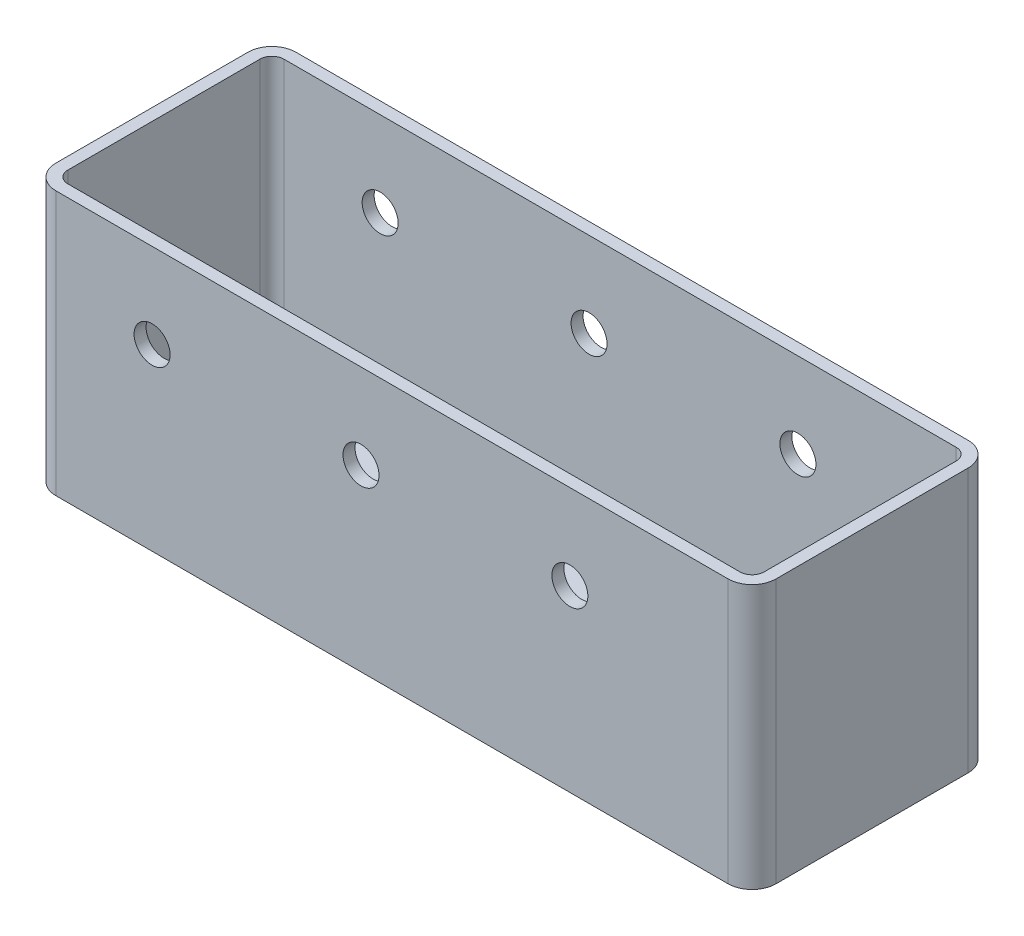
ISO-10303-21;
HEADER;
FILE_DESCRIPTION(('STEP AP214'),'2;1');
FILE_NAME('part.step','',(''),(''),'','','');
FILE_SCHEMA(('AUTOMOTIVE_DESIGN { 1 0 10303 214 1 1 1 1 }'));
ENDSEC;
DATA;
#1=APPLICATION_CONTEXT('core data for automotive mechanical design processes');
#2=APPLICATION_PROTOCOL_DEFINITION('international standard','automotive_design',2000,#1);
#3=PRODUCT_CONTEXT('',#1,'mechanical');
#4=PRODUCT('Part','Part','',(#3));
#5=PRODUCT_RELATED_PRODUCT_CATEGORY('part','',(#4));
#6=PRODUCT_DEFINITION_FORMATION('','',#4);
#7=PRODUCT_DEFINITION_CONTEXT('part definition',#1,'design');
#8=PRODUCT_DEFINITION('design','',#6,#7);
#9=PRODUCT_DEFINITION_SHAPE('','',#8);
#10=(LENGTH_UNIT() NAMED_UNIT(*) SI_UNIT(.MILLI.,.METRE.));
#11=(NAMED_UNIT(*) PLANE_ANGLE_UNIT() SI_UNIT($,.RADIAN.));
#12=(NAMED_UNIT(*) SI_UNIT($,.STERADIAN.) SOLID_ANGLE_UNIT());
#13=UNCERTAINTY_MEASURE_WITH_UNIT(LENGTH_MEASURE(1.E-05),#10,'distance_accuracy_value','');
#14=(GEOMETRIC_REPRESENTATION_CONTEXT(3) GLOBAL_UNCERTAINTY_ASSIGNED_CONTEXT((#13)) GLOBAL_UNIT_ASSIGNED_CONTEXT((#10,
#11,#12)) REPRESENTATION_CONTEXT('',''));
#15=CARTESIAN_POINT('',(0.,0.,0.));
#16=DIRECTION('',(0.,0.,1.));
#17=DIRECTION('',(1.,0.,0.));
#18=AXIS2_PLACEMENT_3D('',#15,#16,#17);
#19=CARTESIAN_POINT('',(355.6,12.7,101.6));
#20=DIRECTION('',(0.,-1.,0.));
#21=DIRECTION('',(0.,0.,-1.));
#22=AXIS2_PLACEMENT_3D('',#19,#20,#21);
#23=CYLINDRICAL_SURFACE('',#22,25.4);
#24=CARTESIAN_POINT('',(355.6,0.,101.6));
#25=DIRECTION('',(0.,1.,0.));
#26=DIRECTION('',(0.,0.,-1.));
#27=AXIS2_PLACEMENT_3D('',#24,#25,#26);
#28=CIRCLE('',#27,25.4);
#29=CARTESIAN_POINT('',(355.6,0.,127.));
#30=VERTEX_POINT('',#29);
#31=CARTESIAN_POINT('',(381.,0.,101.6));
#32=VERTEX_POINT('',#31);
#33=EDGE_CURVE('E249',#30,#32,#28,.T.);
#34=ORIENTED_EDGE('',*,*,#33,.T.);
#35=DIRECTION('',(0.,-1.,0.));
#36=VECTOR('',#35,1.);
#37=CARTESIAN_POINT('',(381.,12.7,101.6));
#38=LINE('',#37,#36);
#39=CARTESIAN_POINT('',(381.,279.400000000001,101.6));
#40=VERTEX_POINT('',#39);
#41=EDGE_CURVE('E11',#40,#32,#38,.T.);
#42=ORIENTED_EDGE('',*,*,#41,.F.);
#43=CARTESIAN_POINT('',(355.6,279.400000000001,101.6));
#44=DIRECTION('',(0.,1.,0.));
#45=DIRECTION('',(0.,0.,1.));
#46=AXIS2_PLACEMENT_3D('',#43,#44,#45);
#47=CIRCLE('',#46,25.4);
#48=CARTESIAN_POINT('',(355.6,279.400000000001,127.));
#49=VERTEX_POINT('',#48);
#50=EDGE_CURVE('E171',#49,#40,#47,.T.);
#51=ORIENTED_EDGE('',*,*,#50,.F.);
#52=DIRECTION('',(0.,-1.,0.));
#53=VECTOR('',#52,1.);
#54=CARTESIAN_POINT('',(355.6,12.7,127.));
#55=LINE('',#54,#53);
#56=EDGE_CURVE('E265',#49,#30,#55,.T.);
#57=ORIENTED_EDGE('',*,*,#56,.T.);
#58=EDGE_LOOP('',(#34,#42,#51,#57));
#59=FACE_BOUND('',#58,.T.);
#60=ADVANCED_FACE('F39',(#59),#23,.T.);
#61=CARTESIAN_POINT('',(381.,12.7,-101.6));
#62=DIRECTION('',(-1.,0.,0.));
#63=DIRECTION('',(0.,0.,1.));
#64=AXIS2_PLACEMENT_3D('',#61,#62,#63);
#65=PLANE('',#64);
#66=DIRECTION('',(0.,0.,-1.));
#67=VECTOR('',#66,1.);
#68=CARTESIAN_POINT('',(381.,0.,-101.6));
#69=LINE('',#68,#67);
#70=CARTESIAN_POINT('',(381.,0.,-101.6));
#71=VERTEX_POINT('',#70);
#72=EDGE_CURVE('E252',#32,#71,#69,.T.);
#73=ORIENTED_EDGE('',*,*,#72,.T.);
#74=DIRECTION('',(0.,-1.,0.));
#75=VECTOR('',#74,1.);
#76=CARTESIAN_POINT('',(381.,12.7,-101.6));
#77=LINE('',#76,#75);
#78=CARTESIAN_POINT('',(381.,279.400000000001,-101.6));
#79=VERTEX_POINT('',#78);
#80=EDGE_CURVE('E47',#79,#71,#77,.T.);
#81=ORIENTED_EDGE('',*,*,#80,.F.);
#82=DIRECTION('',(0.,0.,-1.));
#83=VECTOR('',#82,1.);
#84=CARTESIAN_POINT('',(381.,279.400000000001,101.6));
#85=LINE('',#84,#83);
#86=EDGE_CURVE('E228',#40,#79,#85,.T.);
#87=ORIENTED_EDGE('',*,*,#86,.F.);
#88=ORIENTED_EDGE('',*,*,#41,.T.);
#89=EDGE_LOOP('',(#73,#81,#87,#88));
#90=FACE_BOUND('',#89,.T.);
#91=ADVANCED_FACE('F340',(#90),#65,.F.);
#92=CARTESIAN_POINT('',(355.6,12.7,-101.6));
#93=DIRECTION('',(0.,-1.,0.));
#94=DIRECTION('',(0.,0.,-1.));
#95=AXIS2_PLACEMENT_3D('',#92,#93,#94);
#96=CYLINDRICAL_SURFACE('',#95,25.4);
#97=CARTESIAN_POINT('',(355.6,0.,-101.6));
#98=DIRECTION('',(0.,1.,0.));
#99=DIRECTION('',(0.,0.,-1.));
#100=AXIS2_PLACEMENT_3D('',#97,#98,#99);
#101=CIRCLE('',#100,25.4);
#102=CARTESIAN_POINT('',(355.6,0.,-127.));
#103=VERTEX_POINT('',#102);
#104=EDGE_CURVE('E254',#71,#103,#101,.T.);
#105=ORIENTED_EDGE('',*,*,#104,.T.);
#106=DIRECTION('',(0.,-1.,0.));
#107=VECTOR('',#106,1.);
#108=CARTESIAN_POINT('',(355.6,12.7,-127.));
#109=LINE('',#108,#107);
#110=CARTESIAN_POINT('',(355.6,279.400000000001,-127.));
#111=VERTEX_POINT('',#110);
#112=EDGE_CURVE('E278',#111,#103,#109,.T.);
#113=ORIENTED_EDGE('',*,*,#112,.F.);
#114=CARTESIAN_POINT('',(355.6,279.400000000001,-101.6));
#115=DIRECTION('',(0.,1.,0.));
#116=DIRECTION('',(0.,0.,1.));
#117=AXIS2_PLACEMENT_3D('',#114,#115,#116);
#118=CIRCLE('',#117,25.4);
#119=EDGE_CURVE('E231',#79,#111,#118,.T.);
#120=ORIENTED_EDGE('',*,*,#119,.F.);
#121=ORIENTED_EDGE('',*,*,#80,.T.);
#122=EDGE_LOOP('',(#105,#113,#120,#121));
#123=FACE_BOUND('',#122,.T.);
#124=ADVANCED_FACE('F345',(#123),#96,.T.);
#125=CARTESIAN_POINT('',(355.6,12.7,-127.));
#126=DIRECTION('',(0.,0.,1.));
#127=DIRECTION('',(1.,0.,0.));
#128=AXIS2_PLACEMENT_3D('',#125,#126,#127);
#129=PLANE('',#128);
#130=CARTESIAN_POINT('',(-253.79825288,189.484,-127.));
#131=DIRECTION('',(0.,0.,1.));
#132=DIRECTION('',(1.,0.,0.));
#133=AXIS2_PLACEMENT_3D('',#130,#131,#132);
#134=CIRCLE('',#133,19.05);
#135=CARTESIAN_POINT('',(-234.74825288,189.484,-127.));
#136=VERTEX_POINT('',#135);
#137=EDGE_CURVE('E195',#136,#136,#134,.T.);
#138=ORIENTED_EDGE('',*,*,#137,.T.);
#139=EDGE_LOOP('',(#138));
#140=FACE_BOUND('',#139,.T.);
#141=CARTESIAN_POINT('',(-32.7660000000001,189.484,-127.));
#142=DIRECTION('',(0.,0.,1.));
#143=DIRECTION('',(1.,0.,0.));
#144=AXIS2_PLACEMENT_3D('',#141,#142,#143);
#145=CIRCLE('',#144,19.05);
#146=CARTESIAN_POINT('',(-13.7160000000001,189.484,-127.));
#147=VERTEX_POINT('',#146);
#148=EDGE_CURVE('E306',#147,#147,#145,.T.);
#149=ORIENTED_EDGE('',*,*,#148,.T.);
#150=EDGE_LOOP('',(#149));
#151=FACE_BOUND('',#150,.T.);
#152=CARTESIAN_POINT('',(188.214,189.484,-127.));
#153=DIRECTION('',(0.,0.,1.));
#154=DIRECTION('',(1.,0.,0.));
#155=AXIS2_PLACEMENT_3D('',#152,#153,#154);
#156=CIRCLE('',#155,19.05);
#157=CARTESIAN_POINT('',(207.264,189.484,-127.));
#158=VERTEX_POINT('',#157);
#159=EDGE_CURVE('E289',#158,#158,#156,.T.);
#160=ORIENTED_EDGE('',*,*,#159,.T.);
#161=EDGE_LOOP('',(#160));
#162=FACE_BOUND('',#161,.T.);
#163=DIRECTION('',(-1.,0.,0.));
#164=VECTOR('',#163,1.);
#165=CARTESIAN_POINT('',(355.6,0.,-127.));
#166=LINE('',#165,#164);
#167=CARTESIAN_POINT('',(-355.6,0.,-127.));
#168=VERTEX_POINT('',#167);
#169=EDGE_CURVE('E256',#103,#168,#166,.T.);
#170=ORIENTED_EDGE('',*,*,#169,.T.);
#171=DIRECTION('',(0.,-1.,0.));
#172=VECTOR('',#171,1.);
#173=CARTESIAN_POINT('',(-355.6,12.7,-127.));
#174=LINE('',#173,#172);
#175=CARTESIAN_POINT('',(-355.6,279.400000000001,-127.));
#176=VERTEX_POINT('',#175);
#177=EDGE_CURVE('E275',#176,#168,#174,.T.);
#178=ORIENTED_EDGE('',*,*,#177,.F.);
#179=DIRECTION('',(-1.,0.,0.));
#180=VECTOR('',#179,1.);
#181=CARTESIAN_POINT('',(355.6,279.400000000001,-127.));
#182=LINE('',#181,#180);
#183=EDGE_CURVE('E234',#111,#176,#182,.T.);
#184=ORIENTED_EDGE('',*,*,#183,.F.);
#185=ORIENTED_EDGE('',*,*,#112,.T.);
#186=EDGE_LOOP('',(#170,#178,#184,#185));
#187=FACE_BOUND('',#186,.T.);
#188=ADVANCED_FACE('F317',(#140,#151,#162,#187),#129,.F.);
#189=CARTESIAN_POINT('',(-355.6,12.7,-101.6));
#190=DIRECTION('',(0.,-1.,0.));
#191=DIRECTION('',(0.,0.,-1.));
#192=AXIS2_PLACEMENT_3D('',#189,#190,#191);
#193=CYLINDRICAL_SURFACE('',#192,25.4);
#194=CARTESIAN_POINT('',(-355.6,0.,-101.6));
#195=DIRECTION('',(0.,1.,0.));
#196=DIRECTION('',(0.,0.,1.));
#197=AXIS2_PLACEMENT_3D('',#194,#195,#196);
#198=CIRCLE('',#197,25.4);
#199=CARTESIAN_POINT('',(-381.,0.,-101.6));
#200=VERTEX_POINT('',#199);
#201=EDGE_CURVE('E258',#168,#200,#198,.T.);
#202=ORIENTED_EDGE('',*,*,#201,.T.);
#203=DIRECTION('',(0.,-1.,0.));
#204=VECTOR('',#203,1.);
#205=CARTESIAN_POINT('',(-381.,12.7,-101.6));
#206=LINE('',#205,#204);
#207=CARTESIAN_POINT('',(-381.,279.400000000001,-101.6));
#208=VERTEX_POINT('',#207);
#209=EDGE_CURVE('E272',#208,#200,#206,.T.);
#210=ORIENTED_EDGE('',*,*,#209,.F.);
#211=CARTESIAN_POINT('',(-355.6,279.400000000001,-101.6));
#212=DIRECTION('',(0.,1.,0.));
#213=DIRECTION('',(0.,0.,1.));
#214=AXIS2_PLACEMENT_3D('',#211,#212,#213);
#215=CIRCLE('',#214,25.4);
#216=EDGE_CURVE('E237',#176,#208,#215,.T.);
#217=ORIENTED_EDGE('',*,*,#216,.F.);
#218=ORIENTED_EDGE('',*,*,#177,.T.);
#219=EDGE_LOOP('',(#202,#210,#217,#218));
#220=FACE_BOUND('',#219,.T.);
#221=ADVANCED_FACE('F369',(#220),#193,.T.);
#222=CARTESIAN_POINT('',(-381.,12.7,-101.6));
#223=DIRECTION('',(1.,0.,0.));
#224=DIRECTION('',(0.,0.,-1.));
#225=AXIS2_PLACEMENT_3D('',#222,#223,#224);
#226=PLANE('',#225);
#227=DIRECTION('',(0.,0.,1.));
#228=VECTOR('',#227,1.);
#229=CARTESIAN_POINT('',(-381.,0.,-101.6));
#230=LINE('',#229,#228);
#231=CARTESIAN_POINT('',(-381.,0.,101.6));
#232=VERTEX_POINT('',#231);
#233=EDGE_CURVE('E260',#200,#232,#230,.T.);
#234=ORIENTED_EDGE('',*,*,#233,.T.);
#235=DIRECTION('',(0.,-1.,0.));
#236=VECTOR('',#235,1.);
#237=CARTESIAN_POINT('',(-381.,12.7,101.6));
#238=LINE('',#237,#236);
#239=CARTESIAN_POINT('',(-381.,279.400000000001,101.6));
#240=VERTEX_POINT('',#239);
#241=EDGE_CURVE('E269',#240,#232,#238,.T.);
#242=ORIENTED_EDGE('',*,*,#241,.F.);
#243=DIRECTION('',(0.,0.,1.));
#244=VECTOR('',#243,1.);
#245=CARTESIAN_POINT('',(-381.,279.400000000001,-101.6));
#246=LINE('',#245,#244);
#247=EDGE_CURVE('E240',#208,#240,#246,.T.);
#248=ORIENTED_EDGE('',*,*,#247,.F.);
#249=ORIENTED_EDGE('',*,*,#209,.T.);
#250=EDGE_LOOP('',(#234,#242,#248,#249));
#251=FACE_BOUND('',#250,.T.);
#252=ADVANCED_FACE('F365',(#251),#226,.F.);
#253=CARTESIAN_POINT('',(-355.6,12.7,101.6));
#254=DIRECTION('',(0.,-1.,0.));
#255=DIRECTION('',(0.,0.,-1.));
#256=AXIS2_PLACEMENT_3D('',#253,#254,#255);
#257=CYLINDRICAL_SURFACE('',#256,25.4);
#258=CARTESIAN_POINT('',(-355.6,0.,101.6));
#259=DIRECTION('',(0.,1.,0.));
#260=DIRECTION('',(0.,0.,-1.));
#261=AXIS2_PLACEMENT_3D('',#258,#259,#260);
#262=CIRCLE('',#261,25.4);
#263=CARTESIAN_POINT('',(-355.6,0.,127.));
#264=VERTEX_POINT('',#263);
#265=EDGE_CURVE('E262',#232,#264,#262,.T.);
#266=ORIENTED_EDGE('',*,*,#265,.T.);
#267=DIRECTION('',(0.,-1.,0.));
#268=VECTOR('',#267,1.);
#269=CARTESIAN_POINT('',(-355.6,12.7,127.));
#270=LINE('',#269,#268);
#271=CARTESIAN_POINT('',(-355.6,279.400000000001,127.));
#272=VERTEX_POINT('',#271);
#273=EDGE_CURVE('E267',#272,#264,#270,.T.);
#274=ORIENTED_EDGE('',*,*,#273,.F.);
#275=CARTESIAN_POINT('',(-355.6,279.400000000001,101.6));
#276=DIRECTION('',(0.,1.,0.));
#277=DIRECTION('',(0.,0.,1.));
#278=AXIS2_PLACEMENT_3D('',#275,#276,#277);
#279=CIRCLE('',#278,25.4);
#280=EDGE_CURVE('E243',#240,#272,#279,.T.);
#281=ORIENTED_EDGE('',*,*,#280,.F.);
#282=ORIENTED_EDGE('',*,*,#241,.T.);
#283=EDGE_LOOP('',(#266,#274,#281,#282));
#284=FACE_BOUND('',#283,.T.);
#285=ADVANCED_FACE('F361',(#284),#257,.T.);
#286=CARTESIAN_POINT('',(355.6,12.7,127.));
#287=DIRECTION('',(0.,0.,-1.));
#288=DIRECTION('',(-1.,0.,0.));
#289=AXIS2_PLACEMENT_3D('',#286,#287,#288);
#290=PLANE('',#289);
#291=CARTESIAN_POINT('',(-253.79825288,189.484,127.));
#292=DIRECTION('',(0.,0.,-1.));
#293=DIRECTION('',(-1.,0.,0.));
#294=AXIS2_PLACEMENT_3D('',#291,#292,#293);
#295=CIRCLE('',#294,19.05);
#296=CARTESIAN_POINT('',(-272.84825288,189.484,127.));
#297=VERTEX_POINT('',#296);
#298=EDGE_CURVE('E312',#297,#297,#295,.T.);
#299=ORIENTED_EDGE('',*,*,#298,.T.);
#300=EDGE_LOOP('',(#299));
#301=FACE_BOUND('',#300,.T.);
#302=CARTESIAN_POINT('',(-32.7660000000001,189.484,127.));
#303=DIRECTION('',(0.,0.,-1.));
#304=DIRECTION('',(-1.,0.,0.));
#305=AXIS2_PLACEMENT_3D('',#302,#303,#304);
#306=CIRCLE('',#305,19.05);
#307=CARTESIAN_POINT('',(-51.8160000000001,189.484,127.));
#308=VERTEX_POINT('',#307);
#309=EDGE_CURVE('E293',#308,#308,#306,.T.);
#310=ORIENTED_EDGE('',*,*,#309,.T.);
#311=EDGE_LOOP('',(#310));
#312=FACE_BOUND('',#311,.T.);
#313=CARTESIAN_POINT('',(188.214,189.484,127.));
#314=DIRECTION('',(0.,0.,-1.));
#315=DIRECTION('',(-1.,0.,0.));
#316=AXIS2_PLACEMENT_3D('',#313,#314,#315);
#317=CIRCLE('',#316,19.05);
#318=CARTESIAN_POINT('',(169.164,189.484,127.));
#319=VERTEX_POINT('',#318);
#320=EDGE_CURVE('E296',#319,#319,#317,.T.);
#321=ORIENTED_EDGE('',*,*,#320,.T.);
#322=EDGE_LOOP('',(#321));
#323=FACE_BOUND('',#322,.T.);
#324=DIRECTION('',(1.,0.,0.));
#325=VECTOR('',#324,1.);
#326=CARTESIAN_POINT('',(355.6,0.,127.));
#327=LINE('',#326,#325);
#328=EDGE_CURVE('E63',#264,#30,#327,.T.);
#329=ORIENTED_EDGE('',*,*,#328,.T.);
#330=ORIENTED_EDGE('',*,*,#56,.F.);
#331=DIRECTION('',(1.,0.,0.));
#332=VECTOR('',#331,1.);
#333=CARTESIAN_POINT('',(-355.6,279.400000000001,127.));
#334=LINE('',#333,#332);
#335=EDGE_CURVE('E246',#272,#49,#334,.T.);
#336=ORIENTED_EDGE('',*,*,#335,.F.);
#337=ORIENTED_EDGE('',*,*,#273,.T.);
#338=EDGE_LOOP('',(#329,#330,#336,#337));
#339=FACE_BOUND('',#338,.T.);
#340=ADVANCED_FACE('F359',(#301,#312,#323,#339),#290,.F.);
#341=CARTESIAN_POINT('',(355.6,0.,101.6));
#342=DIRECTION('',(0.,-1.,0.));
#343=DIRECTION('',(0.,0.,-1.));
#344=AXIS2_PLACEMENT_3D('',#341,#342,#343);
#345=PLANE('',#344);
#346=ORIENTED_EDGE('',*,*,#33,.F.);
#347=ORIENTED_EDGE('',*,*,#328,.F.);
#348=ORIENTED_EDGE('',*,*,#265,.F.);
#349=ORIENTED_EDGE('',*,*,#233,.F.);
#350=ORIENTED_EDGE('',*,*,#201,.F.);
#351=ORIENTED_EDGE('',*,*,#169,.F.);
#352=ORIENTED_EDGE('',*,*,#104,.F.);
#353=ORIENTED_EDGE('',*,*,#72,.F.);
#354=EDGE_LOOP('',(#346,#347,#348,#349,#350,#351,#352,#353));
#355=FACE_BOUND('',#354,.T.);
#356=ADVANCED_FACE('F351',(#355),#345,.T.);
#357=CARTESIAN_POINT('',(355.6,279.400000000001,101.6));
#358=DIRECTION('',(0.,1.,0.));
#359=DIRECTION('',(0.,0.,1.));
#360=AXIS2_PLACEMENT_3D('',#357,#358,#359);
#361=PLANE('',#360);
#362=ORIENTED_EDGE('',*,*,#50,.T.);
#363=ORIENTED_EDGE('',*,*,#86,.T.);
#364=ORIENTED_EDGE('',*,*,#119,.T.);
#365=ORIENTED_EDGE('',*,*,#183,.T.);
#366=ORIENTED_EDGE('',*,*,#216,.T.);
#367=ORIENTED_EDGE('',*,*,#247,.T.);
#368=ORIENTED_EDGE('',*,*,#280,.T.);
#369=ORIENTED_EDGE('',*,*,#335,.T.);
#370=EDGE_LOOP('',(#362,#363,#364,#365,#366,#367,#368,#369));
#371=FACE_BOUND('',#370,.T.);
#372=DIRECTION('',(0.,0.,1.));
#373=VECTOR('',#372,1.);
#374=CARTESIAN_POINT('',(-368.3,279.400000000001,-101.6));
#375=LINE('',#374,#373);
#376=CARTESIAN_POINT('',(-368.3,279.400000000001,-101.6));
#377=VERTEX_POINT('',#376);
#378=CARTESIAN_POINT('',(-368.3,279.400000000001,101.6));
#379=VERTEX_POINT('',#378);
#380=EDGE_CURVE('E163',#377,#379,#375,.T.);
#381=ORIENTED_EDGE('',*,*,#380,.F.);
#382=CARTESIAN_POINT('',(-355.6,279.400000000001,-101.6));
#383=DIRECTION('',(0.,1.,0.));
#384=DIRECTION('',(0.,0.,1.));
#385=AXIS2_PLACEMENT_3D('',#382,#383,#384);
#386=CIRCLE('',#385,12.7);
#387=CARTESIAN_POINT('',(-355.6,279.400000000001,-114.3));
#388=VERTEX_POINT('',#387);
#389=EDGE_CURVE('E155',#388,#377,#386,.T.);
#390=ORIENTED_EDGE('',*,*,#389,.F.);
#391=DIRECTION('',(-1.,0.,0.));
#392=VECTOR('',#391,1.);
#393=CARTESIAN_POINT('',(355.6,279.400000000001,-114.3));
#394=LINE('',#393,#392);
#395=CARTESIAN_POINT('',(355.6,279.400000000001,-114.3));
#396=VERTEX_POINT('',#395);
#397=EDGE_CURVE('E191',#396,#388,#394,.T.);
#398=ORIENTED_EDGE('',*,*,#397,.F.);
#399=CARTESIAN_POINT('',(355.6,279.400000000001,-101.6));
#400=DIRECTION('',(0.,1.,0.));
#401=DIRECTION('',(0.,0.,1.));
#402=AXIS2_PLACEMENT_3D('',#399,#400,#401);
#403=CIRCLE('',#402,12.7);
#404=CARTESIAN_POINT('',(368.3,279.400000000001,-101.6));
#405=VERTEX_POINT('',#404);
#406=EDGE_CURVE('E188',#405,#396,#403,.T.);
#407=ORIENTED_EDGE('',*,*,#406,.F.);
#408=DIRECTION('',(0.,0.,-1.));
#409=VECTOR('',#408,1.);
#410=CARTESIAN_POINT('',(368.3,279.400000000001,101.6));
#411=LINE('',#410,#409);
#412=CARTESIAN_POINT('',(368.3,279.400000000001,101.6));
#413=VERTEX_POINT('',#412);
#414=EDGE_CURVE('E186',#413,#405,#411,.T.);
#415=ORIENTED_EDGE('',*,*,#414,.F.);
#416=CARTESIAN_POINT('',(355.6,279.400000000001,101.6));
#417=DIRECTION('',(0.,1.,0.));
#418=DIRECTION('',(0.,0.,1.));
#419=AXIS2_PLACEMENT_3D('',#416,#417,#418);
#420=CIRCLE('',#419,12.7);
#421=CARTESIAN_POINT('',(355.6,279.400000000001,114.3));
#422=VERTEX_POINT('',#421);
#423=EDGE_CURVE('E184',#422,#413,#420,.T.);
#424=ORIENTED_EDGE('',*,*,#423,.F.);
#425=DIRECTION('',(1.,0.,0.));
#426=VECTOR('',#425,1.);
#427=CARTESIAN_POINT('',(-355.6,279.400000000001,114.3));
#428=LINE('',#427,#426);
#429=CARTESIAN_POINT('',(-355.6,279.400000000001,114.3));
#430=VERTEX_POINT('',#429);
#431=EDGE_CURVE('E179',#430,#422,#428,.T.);
#432=ORIENTED_EDGE('',*,*,#431,.F.);
#433=CARTESIAN_POINT('',(-355.6,279.400000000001,101.6));
#434=DIRECTION('',(0.,1.,0.));
#435=DIRECTION('',(0.,0.,1.));
#436=AXIS2_PLACEMENT_3D('',#433,#434,#435);
#437=CIRCLE('',#436,12.7);
#438=EDGE_CURVE('E177',#379,#430,#437,.T.);
#439=ORIENTED_EDGE('',*,*,#438,.F.);
#440=EDGE_LOOP('',(#381,#390,#398,#407,#415,#424,#432,#439));
#441=FACE_BOUND('',#440,.T.);
#442=ADVANCED_FACE('F175',(#371,#441),#361,.T.);
#443=CARTESIAN_POINT('',(-355.6,279.400000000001,-101.6));
#444=DIRECTION('',(0.,-1.,0.));
#445=DIRECTION('',(0.,0.,-1.));
#446=AXIS2_PLACEMENT_3D('',#443,#444,#445);
#447=CYLINDRICAL_SURFACE('',#446,12.7);
#448=CARTESIAN_POINT('',(-355.6,12.7,-101.6));
#449=DIRECTION('',(0.,1.,0.));
#450=DIRECTION('',(0.,0.,1.));
#451=AXIS2_PLACEMENT_3D('',#448,#449,#450);
#452=CIRCLE('',#451,12.7);
#453=CARTESIAN_POINT('',(-355.6,12.7,-114.3));
#454=VERTEX_POINT('',#453);
#455=CARTESIAN_POINT('',(-368.3,12.7,-101.6));
#456=VERTEX_POINT('',#455);
#457=EDGE_CURVE('E193',#454,#456,#452,.T.);
#458=ORIENTED_EDGE('',*,*,#457,.F.);
#459=DIRECTION('',(0.,-1.,0.));
#460=VECTOR('',#459,1.);
#461=CARTESIAN_POINT('',(-355.6,279.400000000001,-114.3));
#462=LINE('',#461,#460);
#463=EDGE_CURVE('E55',#388,#454,#462,.T.);
#464=ORIENTED_EDGE('',*,*,#463,.F.);
#465=ORIENTED_EDGE('',*,*,#389,.T.);
#466=DIRECTION('',(0.,-1.,0.));
#467=VECTOR('',#466,1.);
#468=CARTESIAN_POINT('',(-368.3,279.400000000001,-101.6));
#469=LINE('',#468,#467);
#470=EDGE_CURVE('E158',#377,#456,#469,.T.);
#471=ORIENTED_EDGE('',*,*,#470,.T.);
#472=EDGE_LOOP('',(#458,#464,#465,#471));
#473=FACE_BOUND('',#472,.T.);
#474=ADVANCED_FACE('F157',(#473),#447,.F.);
#475=CARTESIAN_POINT('',(-368.3,279.400000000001,-101.6));
#476=DIRECTION('',(1.,0.,0.));
#477=DIRECTION('',(0.,0.,-1.));
#478=AXIS2_PLACEMENT_3D('',#475,#476,#477);
#479=PLANE('',#478);
#480=DIRECTION('',(0.,0.,1.));
#481=VECTOR('',#480,1.);
#482=CARTESIAN_POINT('',(-368.3,12.7,-101.6));
#483=LINE('',#482,#481);
#484=CARTESIAN_POINT('',(-368.3,12.7,101.6));
#485=VERTEX_POINT('',#484);
#486=EDGE_CURVE('E170',#456,#485,#483,.T.);
#487=ORIENTED_EDGE('',*,*,#486,.F.);
#488=ORIENTED_EDGE('',*,*,#470,.F.);
#489=ORIENTED_EDGE('',*,*,#380,.T.);
#490=DIRECTION('',(0.,-1.,0.));
#491=VECTOR('',#490,1.);
#492=CARTESIAN_POINT('',(-368.3,279.400000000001,101.6));
#493=LINE('',#492,#491);
#494=EDGE_CURVE('E172',#379,#485,#493,.T.);
#495=ORIENTED_EDGE('',*,*,#494,.T.);
#496=EDGE_LOOP('',(#487,#488,#489,#495));
#497=FACE_BOUND('',#496,.T.);
#498=ADVANCED_FACE('F167',(#497),#479,.T.);
#499=CARTESIAN_POINT('',(-355.6,279.400000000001,101.6));
#500=DIRECTION('',(0.,-1.,0.));
#501=DIRECTION('',(0.,0.,-1.));
#502=AXIS2_PLACEMENT_3D('',#499,#500,#501);
#503=CYLINDRICAL_SURFACE('',#502,12.7);
#504=CARTESIAN_POINT('',(-355.6,12.7,101.6));
#505=DIRECTION('',(0.,1.,0.));
#506=DIRECTION('',(0.,0.,1.));
#507=AXIS2_PLACEMENT_3D('',#504,#505,#506);
#508=CIRCLE('',#507,12.7);
#509=CARTESIAN_POINT('',(-355.6,12.7,114.3));
#510=VERTEX_POINT('',#509);
#511=EDGE_CURVE('E197',#485,#510,#508,.T.);
#512=ORIENTED_EDGE('',*,*,#511,.F.);
#513=ORIENTED_EDGE('',*,*,#494,.F.);
#514=ORIENTED_EDGE('',*,*,#438,.T.);
#515=DIRECTION('',(0.,-1.,0.));
#516=VECTOR('',#515,1.);
#517=CARTESIAN_POINT('',(-355.6,279.400000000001,114.3));
#518=LINE('',#517,#516);
#519=EDGE_CURVE('E223',#430,#510,#518,.T.);
#520=ORIENTED_EDGE('',*,*,#519,.T.);
#521=EDGE_LOOP('',(#512,#513,#514,#520));
#522=FACE_BOUND('',#521,.T.);
#523=ADVANCED_FACE('F402',(#522),#503,.F.);
#524=CARTESIAN_POINT('',(-355.6,279.400000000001,114.3));
#525=DIRECTION('',(0.,0.,-1.));
#526=DIRECTION('',(-1.,0.,0.));
#527=AXIS2_PLACEMENT_3D('',#524,#525,#526);
#528=PLANE('',#527);
#529=CARTESIAN_POINT('',(-253.79825288,189.484,114.3));
#530=DIRECTION('',(0.,0.,-1.));
#531=DIRECTION('',(-1.,0.,0.));
#532=AXIS2_PLACEMENT_3D('',#529,#530,#531);
#533=CIRCLE('',#532,19.05);
#534=CARTESIAN_POINT('',(-272.84825288,189.484,114.3));
#535=VERTEX_POINT('',#534);
#536=EDGE_CURVE('E309',#535,#535,#533,.T.);
#537=ORIENTED_EDGE('',*,*,#536,.F.);
#538=EDGE_LOOP('',(#537));
#539=FACE_BOUND('',#538,.T.);
#540=CARTESIAN_POINT('',(-32.7660000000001,189.484,114.3));
#541=DIRECTION('',(0.,0.,-1.));
#542=DIRECTION('',(-1.,0.,0.));
#543=AXIS2_PLACEMENT_3D('',#540,#541,#542);
#544=CIRCLE('',#543,19.05);
#545=CARTESIAN_POINT('',(-51.8160000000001,189.484,114.3));
#546=VERTEX_POINT('',#545);
#547=EDGE_CURVE('E288',#546,#546,#544,.T.);
#548=ORIENTED_EDGE('',*,*,#547,.F.);
#549=EDGE_LOOP('',(#548));
#550=FACE_BOUND('',#549,.T.);
#551=CARTESIAN_POINT('',(188.214,189.484,114.3));
#552=DIRECTION('',(0.,0.,-1.));
#553=DIRECTION('',(-1.,0.,0.));
#554=AXIS2_PLACEMENT_3D('',#551,#552,#553);
#555=CIRCLE('',#554,19.05);
#556=CARTESIAN_POINT('',(169.164,189.484,114.3));
#557=VERTEX_POINT('',#556);
#558=EDGE_CURVE('E285',#557,#557,#555,.T.);
#559=ORIENTED_EDGE('',*,*,#558,.F.);
#560=EDGE_LOOP('',(#559));
#561=FACE_BOUND('',#560,.T.);
#562=DIRECTION('',(1.,0.,0.));
#563=VECTOR('',#562,1.);
#564=CARTESIAN_POINT('',(-355.6,12.7,114.3));
#565=LINE('',#564,#563);
#566=CARTESIAN_POINT('',(355.6,12.7,114.3));
#567=VERTEX_POINT('',#566);
#568=EDGE_CURVE('E200',#510,#567,#565,.T.);
#569=ORIENTED_EDGE('',*,*,#568,.F.);
#570=ORIENTED_EDGE('',*,*,#519,.F.);
#571=ORIENTED_EDGE('',*,*,#431,.T.);
#572=DIRECTION('',(0.,-1.,0.));
#573=VECTOR('',#572,1.);
#574=CARTESIAN_POINT('',(355.6,279.400000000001,114.3));
#575=LINE('',#574,#573);
#576=EDGE_CURVE('E221',#422,#567,#575,.T.);
#577=ORIENTED_EDGE('',*,*,#576,.T.);
#578=EDGE_LOOP('',(#569,#570,#571,#577));
#579=FACE_BOUND('',#578,.T.);
#580=ADVANCED_FACE('F405',(#539,#550,#561,#579),#528,.T.);
#581=CARTESIAN_POINT('',(355.6,279.400000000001,101.6));
#582=DIRECTION('',(0.,-1.,0.));
#583=DIRECTION('',(0.,0.,-1.));
#584=AXIS2_PLACEMENT_3D('',#581,#582,#583);
#585=CYLINDRICAL_SURFACE('',#584,12.7);
#586=CARTESIAN_POINT('',(355.6,12.7,101.6));
#587=DIRECTION('',(0.,1.,0.));
#588=DIRECTION('',(0.,0.,1.));
#589=AXIS2_PLACEMENT_3D('',#586,#587,#588);
#590=CIRCLE('',#589,12.7);
#591=CARTESIAN_POINT('',(368.3,12.7,101.6));
#592=VERTEX_POINT('',#591);
#593=EDGE_CURVE('E203',#567,#592,#590,.T.);
#594=ORIENTED_EDGE('',*,*,#593,.F.);
#595=ORIENTED_EDGE('',*,*,#576,.F.);
#596=ORIENTED_EDGE('',*,*,#423,.T.);
#597=DIRECTION('',(0.,-1.,0.));
#598=VECTOR('',#597,1.);
#599=CARTESIAN_POINT('',(368.3,279.400000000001,101.6));
#600=LINE('',#599,#598);
#601=EDGE_CURVE('E219',#413,#592,#600,.T.);
#602=ORIENTED_EDGE('',*,*,#601,.T.);
#603=EDGE_LOOP('',(#594,#595,#596,#602));
#604=FACE_BOUND('',#603,.T.);
#605=ADVANCED_FACE('F409',(#604),#585,.F.);
#606=CARTESIAN_POINT('',(368.3,279.400000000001,101.6));
#607=DIRECTION('',(-1.,0.,0.));
#608=DIRECTION('',(0.,0.,1.));
#609=AXIS2_PLACEMENT_3D('',#606,#607,#608);
#610=PLANE('',#609);
#611=DIRECTION('',(0.,0.,-1.));
#612=VECTOR('',#611,1.);
#613=CARTESIAN_POINT('',(368.3,12.7,101.6));
#614=LINE('',#613,#612);
#615=CARTESIAN_POINT('',(368.3,12.7,-101.6));
#616=VERTEX_POINT('',#615);
#617=EDGE_CURVE('E206',#592,#616,#614,.T.);
#618=ORIENTED_EDGE('',*,*,#617,.F.);
#619=ORIENTED_EDGE('',*,*,#601,.F.);
#620=ORIENTED_EDGE('',*,*,#414,.T.);
#621=DIRECTION('',(0.,-1.,0.));
#622=VECTOR('',#621,1.);
#623=CARTESIAN_POINT('',(368.3,279.400000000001,-101.6));
#624=LINE('',#623,#622);
#625=EDGE_CURVE('E217',#405,#616,#624,.T.);
#626=ORIENTED_EDGE('',*,*,#625,.T.);
#627=EDGE_LOOP('',(#618,#619,#620,#626));
#628=FACE_BOUND('',#627,.T.);
#629=ADVANCED_FACE('F413',(#628),#610,.T.);
#630=CARTESIAN_POINT('',(355.6,279.400000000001,-101.6));
#631=DIRECTION('',(0.,-1.,0.));
#632=DIRECTION('',(0.,0.,-1.));
#633=AXIS2_PLACEMENT_3D('',#630,#631,#632);
#634=CYLINDRICAL_SURFACE('',#633,12.7);
#635=CARTESIAN_POINT('',(355.6,12.7,-101.6));
#636=DIRECTION('',(0.,1.,0.));
#637=DIRECTION('',(0.,0.,1.));
#638=AXIS2_PLACEMENT_3D('',#635,#636,#637);
#639=CIRCLE('',#638,12.7);
#640=CARTESIAN_POINT('',(355.6,12.7,-114.3));
#641=VERTEX_POINT('',#640);
#642=EDGE_CURVE('E209',#616,#641,#639,.T.);
#643=ORIENTED_EDGE('',*,*,#642,.F.);
#644=ORIENTED_EDGE('',*,*,#625,.F.);
#645=ORIENTED_EDGE('',*,*,#406,.T.);
#646=DIRECTION('',(0.,-1.,0.));
#647=VECTOR('',#646,1.);
#648=CARTESIAN_POINT('',(355.6,279.400000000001,-114.3));
#649=LINE('',#648,#647);
#650=EDGE_CURVE('E215',#396,#641,#649,.T.);
#651=ORIENTED_EDGE('',*,*,#650,.T.);
#652=EDGE_LOOP('',(#643,#644,#645,#651));
#653=FACE_BOUND('',#652,.T.);
#654=ADVANCED_FACE('F417',(#653),#634,.F.);
#655=CARTESIAN_POINT('',(355.6,279.400000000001,-114.3));
#656=DIRECTION('',(0.,0.,1.));
#657=DIRECTION('',(1.,0.,0.));
#658=AXIS2_PLACEMENT_3D('',#655,#656,#657);
#659=PLANE('',#658);
#660=CARTESIAN_POINT('',(-253.79825288,189.484,-114.3));
#661=DIRECTION('',(0.,0.,1.));
#662=DIRECTION('',(1.,0.,0.));
#663=AXIS2_PLACEMENT_3D('',#660,#661,#662);
#664=CIRCLE('',#663,19.05);
#665=CARTESIAN_POINT('',(-234.74825288,189.484,-114.3));
#666=VERTEX_POINT('',#665);
#667=EDGE_CURVE('E42',#666,#666,#664,.T.);
#668=ORIENTED_EDGE('',*,*,#667,.F.);
#669=EDGE_LOOP('',(#668));
#670=FACE_BOUND('',#669,.T.);
#671=CARTESIAN_POINT('',(-32.7660000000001,189.484,-114.3));
#672=DIRECTION('',(0.,0.,1.));
#673=DIRECTION('',(1.,0.,0.));
#674=AXIS2_PLACEMENT_3D('',#671,#672,#673);
#675=CIRCLE('',#674,19.05);
#676=CARTESIAN_POINT('',(-13.7160000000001,189.484,-114.3));
#677=VERTEX_POINT('',#676);
#678=EDGE_CURVE('E286',#677,#677,#675,.T.);
#679=ORIENTED_EDGE('',*,*,#678,.F.);
#680=EDGE_LOOP('',(#679));
#681=FACE_BOUND('',#680,.T.);
#682=CARTESIAN_POINT('',(188.214,189.484,-114.3));
#683=DIRECTION('',(0.,0.,1.));
#684=DIRECTION('',(1.,0.,0.));
#685=AXIS2_PLACEMENT_3D('',#682,#683,#684);
#686=CIRCLE('',#685,19.05);
#687=CARTESIAN_POINT('',(207.264,189.484,-114.3));
#688=VERTEX_POINT('',#687);
#689=EDGE_CURVE('E283',#688,#688,#686,.T.);
#690=ORIENTED_EDGE('',*,*,#689,.F.);
#691=EDGE_LOOP('',(#690));
#692=FACE_BOUND('',#691,.T.);
#693=DIRECTION('',(-1.,0.,0.));
#694=VECTOR('',#693,1.);
#695=CARTESIAN_POINT('',(355.6,12.7,-114.3));
#696=LINE('',#695,#694);
#697=EDGE_CURVE('E164',#641,#454,#696,.T.);
#698=ORIENTED_EDGE('',*,*,#697,.F.);
#699=ORIENTED_EDGE('',*,*,#650,.F.);
#700=ORIENTED_EDGE('',*,*,#397,.T.);
#701=ORIENTED_EDGE('',*,*,#463,.T.);
#702=EDGE_LOOP('',(#698,#699,#700,#701));
#703=FACE_BOUND('',#702,.T.);
#704=ADVANCED_FACE('F394',(#670,#681,#692,#703),#659,.T.);
#705=CARTESIAN_POINT('',(355.6,12.7,101.6));
#706=DIRECTION('',(0.,-1.,0.));
#707=DIRECTION('',(0.,0.,-1.));
#708=AXIS2_PLACEMENT_3D('',#705,#706,#707);
#709=PLANE('',#708);
#710=ORIENTED_EDGE('',*,*,#697,.T.);
#711=ORIENTED_EDGE('',*,*,#457,.T.);
#712=ORIENTED_EDGE('',*,*,#486,.T.);
#713=ORIENTED_EDGE('',*,*,#511,.T.);
#714=ORIENTED_EDGE('',*,*,#568,.T.);
#715=ORIENTED_EDGE('',*,*,#593,.T.);
#716=ORIENTED_EDGE('',*,*,#617,.T.);
#717=ORIENTED_EDGE('',*,*,#642,.T.);
#718=EDGE_LOOP('',(#710,#711,#712,#713,#714,#715,#716,#717));
#719=FACE_BOUND('',#718,.T.);
#720=ADVANCED_FACE('F391',(#719),#709,.F.);
#721=CARTESIAN_POINT('',(188.214,189.484,-190.5));
#722=DIRECTION('',(0.,0.,1.));
#723=DIRECTION('',(1.,0.,0.));
#724=AXIS2_PLACEMENT_3D('',#721,#722,#723);
#725=CYLINDRICAL_SURFACE('',#724,19.05);
#726=ORIENTED_EDGE('',*,*,#689,.T.);
#727=EDGE_LOOP('',(#726));
#728=FACE_BOUND('',#727,.T.);
#729=ORIENTED_EDGE('',*,*,#159,.F.);
#730=EDGE_LOOP('',(#729));
#731=FACE_BOUND('',#730,.T.);
#732=ADVANCED_FACE('F334',(#728,#731),#725,.F.);
#733=CARTESIAN_POINT('',(-32.7660000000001,189.484,-190.5));
#734=DIRECTION('',(0.,0.,1.));
#735=DIRECTION('',(1.,0.,0.));
#736=AXIS2_PLACEMENT_3D('',#733,#734,#735);
#737=CYLINDRICAL_SURFACE('',#736,19.05);
#738=ORIENTED_EDGE('',*,*,#678,.T.);
#739=EDGE_LOOP('',(#738));
#740=FACE_BOUND('',#739,.T.);
#741=ORIENTED_EDGE('',*,*,#148,.F.);
#742=EDGE_LOOP('',(#741));
#743=FACE_BOUND('',#742,.T.);
#744=ADVANCED_FACE('F323',(#740,#743),#737,.F.);
#745=CARTESIAN_POINT('',(-253.79825288,189.484,-190.5));
#746=DIRECTION('',(0.,0.,1.));
#747=DIRECTION('',(1.,0.,0.));
#748=AXIS2_PLACEMENT_3D('',#745,#746,#747);
#749=CYLINDRICAL_SURFACE('',#748,19.05);
#750=ORIENTED_EDGE('',*,*,#667,.T.);
#751=EDGE_LOOP('',(#750));
#752=FACE_BOUND('',#751,.T.);
#753=ORIENTED_EDGE('',*,*,#137,.F.);
#754=EDGE_LOOP('',(#753));
#755=FACE_BOUND('',#754,.T.);
#756=ADVANCED_FACE('F320',(#752,#755),#749,.F.);
#757=ORIENTED_EDGE('',*,*,#558,.T.);
#758=EDGE_LOOP('',(#757));
#759=FACE_BOUND('',#758,.T.);
#760=ORIENTED_EDGE('',*,*,#320,.F.);
#761=EDGE_LOOP('',(#760));
#762=FACE_BOUND('',#761,.T.);
#763=ADVANCED_FACE('F322',(#759,#762),#725,.F.);
#764=ORIENTED_EDGE('',*,*,#547,.T.);
#765=EDGE_LOOP('',(#764));
#766=FACE_BOUND('',#765,.T.);
#767=ORIENTED_EDGE('',*,*,#309,.F.);
#768=EDGE_LOOP('',(#767));
#769=FACE_BOUND('',#768,.T.);
#770=ADVANCED_FACE('F331',(#766,#769),#737,.F.);
#771=ORIENTED_EDGE('',*,*,#536,.T.);
#772=EDGE_LOOP('',(#771));
#773=FACE_BOUND('',#772,.T.);
#774=ORIENTED_EDGE('',*,*,#298,.F.);
#775=EDGE_LOOP('',(#774));
#776=FACE_BOUND('',#775,.T.);
#777=ADVANCED_FACE('F326',(#773,#776),#749,.F.);
#778=CLOSED_SHELL('',(#60,#91,#124,#188,#221,#252,#285,#340,#356,#442,#474,#498,#523,#580,#605,
#629,#654,#704,#720,#732,#744,#756,#763,#770,#777));
#779=MANIFOLD_SOLID_BREP('B2',#778);
#780=ADVANCED_BREP_SHAPE_REPRESENTATION('',(#18,#779),#14);
#781=SHAPE_DEFINITION_REPRESENTATION(#9,#780);
ENDSEC;
END-ISO-10303-21;
